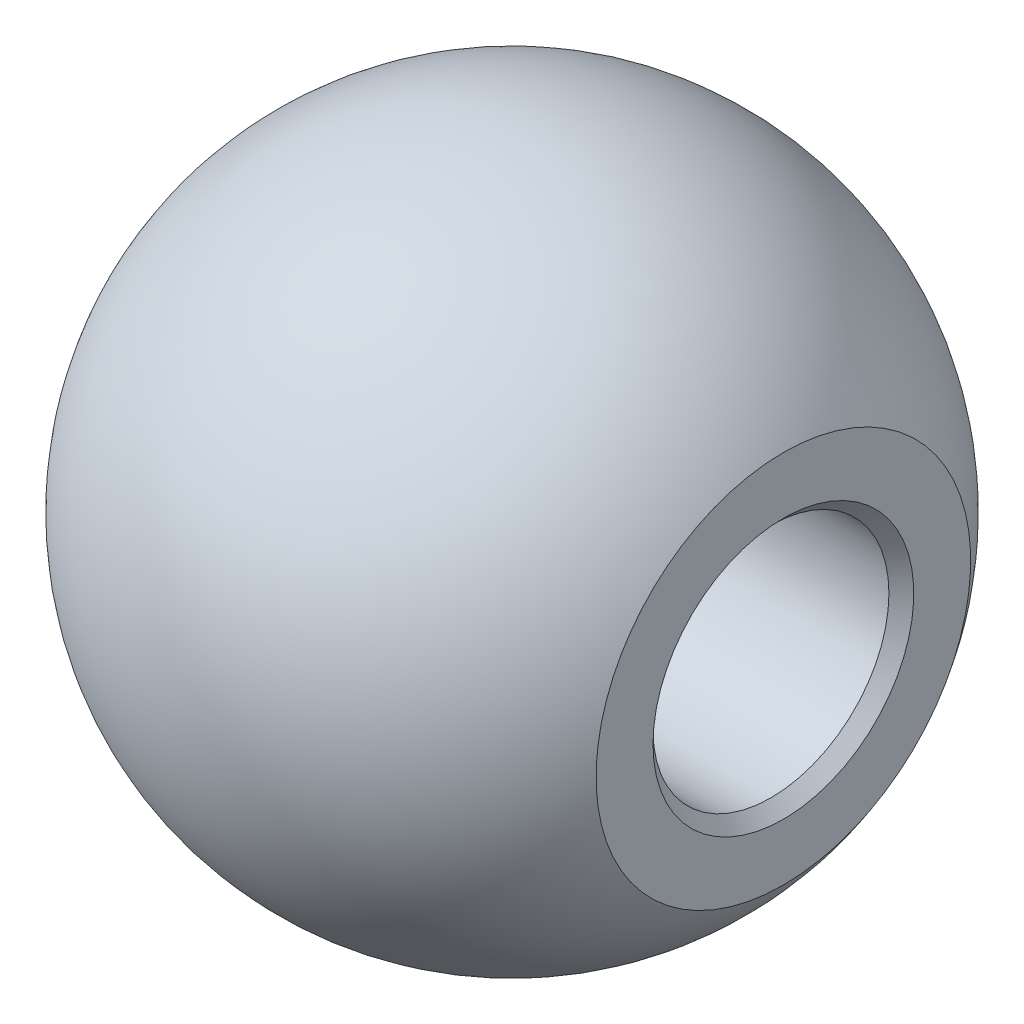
ISO-10303-21;
HEADER;
FILE_DESCRIPTION(('STEP AP214'),'2;1');
FILE_NAME('part.step','',(''),(''),'','','');
FILE_SCHEMA(('AUTOMOTIVE_DESIGN { 1 0 10303 214 1 1 1 1 }'));
ENDSEC;
DATA;
#1=APPLICATION_CONTEXT('core data for automotive mechanical design processes');
#2=APPLICATION_PROTOCOL_DEFINITION('international standard','automotive_design',2000,#1);
#3=PRODUCT_CONTEXT('',#1,'mechanical');
#4=PRODUCT('Part','Part','',(#3));
#5=PRODUCT_RELATED_PRODUCT_CATEGORY('part','',(#4));
#6=PRODUCT_DEFINITION_FORMATION('','',#4);
#7=PRODUCT_DEFINITION_CONTEXT('part definition',#1,'design');
#8=PRODUCT_DEFINITION('design','',#6,#7);
#9=PRODUCT_DEFINITION_SHAPE('','',#8);
#10=(LENGTH_UNIT() NAMED_UNIT(*) SI_UNIT(.MILLI.,.METRE.));
#11=(NAMED_UNIT(*) PLANE_ANGLE_UNIT() SI_UNIT($,.RADIAN.));
#12=(NAMED_UNIT(*) SI_UNIT($,.STERADIAN.) SOLID_ANGLE_UNIT());
#13=UNCERTAINTY_MEASURE_WITH_UNIT(LENGTH_MEASURE(1.E-05),#10,'distance_accuracy_value','');
#14=(GEOMETRIC_REPRESENTATION_CONTEXT(3) GLOBAL_UNCERTAINTY_ASSIGNED_CONTEXT((#13)) GLOBAL_UNIT_ASSIGNED_CONTEXT((#10,
#11,#12)) REPRESENTATION_CONTEXT('',''));
#15=CARTESIAN_POINT('',(0.,0.,0.));
#16=DIRECTION('',(0.,0.,1.));
#17=DIRECTION('',(1.,0.,0.));
#18=AXIS2_PLACEMENT_3D('',#15,#16,#17);
#19=CARTESIAN_POINT('',(0.,0.,0.));
#20=DIRECTION('',(-1.,0.,0.));
#21=DIRECTION('',(0.,0.,1.));
#22=AXIS2_PLACEMENT_3D('',#19,#20,#21);
#23=CYLINDRICAL_SURFACE('',#22,2.413);
#24=CARTESIAN_POINT('',(5.2959,0.,0.));
#25=DIRECTION('',(-1.,0.,0.));
#26=DIRECTION('',(0.,0.,1.));
#27=AXIS2_PLACEMENT_3D('',#24,#25,#26);
#28=CIRCLE('',#27,2.413);
#29=CARTESIAN_POINT('',(5.2959,0.,2.413));
#30=VERTEX_POINT('',#29);
#31=EDGE_CURVE('E10',#30,#30,#28,.F.);
#32=ORIENTED_EDGE('',*,*,#31,.T.);
#33=EDGE_LOOP('',(#32));
#34=FACE_BOUND('',#33,.T.);
#35=CARTESIAN_POINT('',(-5.2959,0.,0.));
#36=DIRECTION('',(-1.,0.,0.));
#37=DIRECTION('',(0.,0.,1.));
#38=AXIS2_PLACEMENT_3D('',#35,#36,#37);
#39=CIRCLE('',#38,2.413);
#40=CARTESIAN_POINT('',(-5.2959,0.,2.413));
#41=VERTEX_POINT('',#40);
#42=EDGE_CURVE('E46',#41,#41,#39,.F.);
#43=ORIENTED_EDGE('',*,*,#42,.F.);
#44=EDGE_LOOP('',(#43));
#45=FACE_BOUND('',#44,.T.);
#46=ADVANCED_FACE('F31',(#34,#45),#23,.F.);
#47=CARTESIAN_POINT('',(5.5499,2.413,0.));
#48=DIRECTION('',(-1.,0.,0.));
#49=DIRECTION('',(0.,0.,1.));
#50=AXIS2_PLACEMENT_3D('',#47,#48,#49);
#51=PLANE('',#50);
#52=CARTESIAN_POINT('',(5.5499,0.,0.));
#53=DIRECTION('',(-1.,0.,0.));
#54=DIRECTION('',(0.,0.,1.));
#55=AXIS2_PLACEMENT_3D('',#52,#53,#54);
#56=CIRCLE('',#55,2.667);
#57=CARTESIAN_POINT('',(5.5499,0.,2.667));
#58=VERTEX_POINT('',#57);
#59=EDGE_CURVE('E38',#58,#58,#56,.T.);
#60=ORIENTED_EDGE('',*,*,#59,.T.);
#61=EDGE_LOOP('',(#60));
#62=FACE_BOUND('',#61,.T.);
#63=CARTESIAN_POINT('',(5.5499,0.,0.));
#64=DIRECTION('',(-1.,0.,0.));
#65=DIRECTION('',(0.,0.,1.));
#66=AXIS2_PLACEMENT_3D('',#63,#64,#65);
#67=CIRCLE('',#66,3.8309397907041);
#68=CARTESIAN_POINT('',(5.5499,3.8309397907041,0.));
#69=VERTEX_POINT('',#68);
#70=EDGE_CURVE('E42',#69,#69,#67,.T.);
#71=ORIENTED_EDGE('',*,*,#70,.F.);
#72=EDGE_LOOP('',(#71));
#73=FACE_BOUND('',#72,.T.);
#74=ADVANCED_FACE('F62',(#62,#73),#51,.F.);
#75=CARTESIAN_POINT('',(0.,0.,0.));
#76=DIRECTION('',(-1.,0.,0.));
#77=DIRECTION('',(0.,1.,0.));
#78=AXIS2_PLACEMENT_3D('',#75,#76,#77);
#79=SPHERICAL_SURFACE('',#78,6.7437);
#80=CARTESIAN_POINT('',(-5.5499,0.,0.));
#81=DIRECTION('',(-1.,0.,0.));
#82=DIRECTION('',(0.,0.,1.));
#83=AXIS2_PLACEMENT_3D('',#80,#81,#82);
#84=CIRCLE('',#83,3.8309397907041);
#85=CARTESIAN_POINT('',(-5.5499,3.8309397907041,0.));
#86=VERTEX_POINT('',#85);
#87=EDGE_CURVE('E54',#86,#86,#84,.T.);
#88=CARTESIAN_POINT('',(5.5499,3.8309397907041,0.));
#89=CARTESIAN_POINT('',(5.47275635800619,3.94270758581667,0.));
#90=CARTESIAN_POINT('',(5.39222826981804,4.05213850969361,0.));
#91=CARTESIAN_POINT('',(5.22471561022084,4.26594188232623,0.));
#92=CARTESIAN_POINT('',(5.13773103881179,4.37031433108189,0.));
#93=CARTESIAN_POINT('',(4.95761782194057,4.57361602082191,0.));
#94=CARTESIAN_POINT('',(4.8644891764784,4.67254526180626,0.));
#95=CARTESIAN_POINT('',(4.67242895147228,4.86460061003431,0.));
#96=CARTESIAN_POINT('',(4.57349737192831,4.95772671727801,0.));
#97=CARTESIAN_POINT('',(4.37019190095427,5.13783572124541,0.));
#98=CARTESIAN_POINT('',(4.26581800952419,5.22481861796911,0.));
#99=CARTESIAN_POINT('',(4.05200884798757,5.39232389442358,0.));
#100=CARTESIAN_POINT('',(3.94257357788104,5.47284627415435,0.));
#101=CARTESIAN_POINT('',(3.71904093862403,5.62713668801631,0.));
#102=CARTESIAN_POINT('',(3.60494356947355,5.7009047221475,0.));
#103=CARTESIAN_POINT('',(3.37250305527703,5.84141728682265,0.));
#104=CARTESIAN_POINT('',(3.25415991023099,5.90816181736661,0.));
#105=CARTESIAN_POINT('',(3.01365965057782,6.03438383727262,0.));
#106=CARTESIAN_POINT('',(2.89150253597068,6.09386132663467,0.));
#107=CARTESIAN_POINT('',(2.64382006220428,6.20533224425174,0.));
#108=CARTESIAN_POINT('',(2.51829470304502,6.25732567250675,0.));
#109=CARTESIAN_POINT('',(2.26433375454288,6.35363875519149,0.));
#110=CARTESIAN_POINT('',(2.13589816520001,6.3979584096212,0.));
#111=CARTESIAN_POINT('',(1.87658538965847,6.47876223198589,0.));
#112=CARTESIAN_POINT('',(1.7457082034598,6.51524639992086,0.));
#113=CARTESIAN_POINT('',(1.48198977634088,6.58024612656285,0.));
#114=CARTESIAN_POINT('',(1.34914853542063,6.60876168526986,0.));
#115=CARTESIAN_POINT('',(1.08198670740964,6.65772014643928,0.));
#116=CARTESIAN_POINT('',(0.947666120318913,6.67816304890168,0.));
#117=CARTESIAN_POINT('',(0.678035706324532,6.71090160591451,0.));
#118=CARTESIAN_POINT('',(0.542725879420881,6.72319726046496,0.));
#119=CARTESIAN_POINT('',(0.271610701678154,6.7395964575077,0.));
#120=CARTESIAN_POINT('',(0.135805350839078,6.7437,0.));
#121=CARTESIAN_POINT('',(-0.135805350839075,6.7437,0.));
#122=CARTESIAN_POINT('',(-0.271610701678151,6.7395964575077,0.));
#123=CARTESIAN_POINT('',(-0.542725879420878,6.72319726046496,0.));
#124=CARTESIAN_POINT('',(-0.67803570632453,6.71090160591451,0.));
#125=CARTESIAN_POINT('',(-0.94766612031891,6.67816304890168,0.));
#126=CARTESIAN_POINT('',(-1.08198670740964,6.65772014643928,0.));
#127=CARTESIAN_POINT('',(-1.34914853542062,6.60876168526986,0.));
#128=CARTESIAN_POINT('',(-1.48198977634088,6.58024612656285,0.));
#129=CARTESIAN_POINT('',(-1.7457082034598,6.51524639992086,0.));
#130=CARTESIAN_POINT('',(-1.87658538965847,6.47876223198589,0.));
#131=CARTESIAN_POINT('',(-2.13589816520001,6.3979584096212,0.));
#132=CARTESIAN_POINT('',(-2.26433375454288,6.35363875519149,0.));
#133=CARTESIAN_POINT('',(-2.51829470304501,6.25732567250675,0.));
#134=CARTESIAN_POINT('',(-2.64382006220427,6.20533224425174,0.));
#135=CARTESIAN_POINT('',(-2.89150253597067,6.09386132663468,0.));
#136=CARTESIAN_POINT('',(-3.01365965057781,6.03438383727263,0.));
#137=CARTESIAN_POINT('',(-3.25415991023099,5.90816181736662,0.));
#138=CARTESIAN_POINT('',(-3.37250305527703,5.84141728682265,0.));
#139=CARTESIAN_POINT('',(-3.60494356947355,5.7009047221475,0.));
#140=CARTESIAN_POINT('',(-3.71904093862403,5.62713668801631,0.));
#141=CARTESIAN_POINT('',(-3.94257357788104,5.47284627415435,0.));
#142=CARTESIAN_POINT('',(-4.05200884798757,5.39232389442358,0.));
#143=CARTESIAN_POINT('',(-4.26581800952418,5.22481861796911,0.));
#144=CARTESIAN_POINT('',(-4.37019190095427,5.13783572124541,0.));
#145=CARTESIAN_POINT('',(-4.57349737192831,4.95772671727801,0.));
#146=CARTESIAN_POINT('',(-4.67242895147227,4.86460061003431,0.));
#147=CARTESIAN_POINT('',(-4.8644891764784,4.67254526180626,0.));
#148=CARTESIAN_POINT('',(-4.95761782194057,4.57361602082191,0.));
#149=CARTESIAN_POINT('',(-5.13773103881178,4.37031433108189,0.));
#150=CARTESIAN_POINT('',(-5.22471561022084,4.26594188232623,0.));
#151=CARTESIAN_POINT('',(-5.39222826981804,4.05213850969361,0.));
#152=CARTESIAN_POINT('',(-5.47275635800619,3.94270758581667,0.));
#153=CARTESIAN_POINT('',(-5.5499,3.8309397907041,0.));
#154=B_SPLINE_CURVE_WITH_KNOTS('',3,(#88,#89,#90,#91,#92,#93,#94,#95,#96,#97,#98,#99,#100,#101,
#102,#103,#104,#105,#106,#107,#108,#109,#110,#111,#112,#113,#114,#115,#116,#117,#118,#119,#120,
#121,#122,#123,#124,#125,#126,#127,#128,#129,#130,#131,#132,#133,#134,#135,#136,#137,#138,#139,
#140,#141,#142,#143,#144,#145,#146,#147,#148,#149,#150,#151,#152,#153),.UNSPECIFIED.,.F.,.F.,(4,
2,2,2,2,2,2,2,2,2,2,2,2,2,2,2,2,2,2,2,2,2,2,2,2,2,2,2,2,2,2,2,4),(0.,0.407354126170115,
0.814708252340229,1.22206237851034,1.62941650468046,2.03677063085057,2.44412475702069,
2.8514788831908,3.25883300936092,3.66618713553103,4.07354126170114,4.48089538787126,
4.88824951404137,5.29560364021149,5.7029577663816,6.11031189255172,6.51766601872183,
6.92502014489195,7.33237427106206,7.73972839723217,8.14708252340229,8.55443664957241,
8.96179077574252,9.36914490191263,9.77649902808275,10.1838531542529,10.591207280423,
10.9985614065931,11.4059155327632,11.8132696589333,12.2206237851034,12.6279779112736,
13.0353320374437),.UNSPECIFIED.);
#155=EDGE_CURVE('BSEAM60',#69,#86,#154,.T.);
#156=ORIENTED_EDGE('',*,*,#70,.T.);
#157=ORIENTED_EDGE('',*,*,#87,.F.);
#158=ORIENTED_EDGE('',*,*,#155,.T.);
#159=ORIENTED_EDGE('',*,*,#155,.F.);
#160=EDGE_LOOP('',(#156,#158,#157,#159));
#161=FACE_BOUND('',#160,.T.);
#162=ADVANCED_FACE('F60',(#161),#79,.T.);
#163=CARTESIAN_POINT('',(5.5499,0.,0.));
#164=DIRECTION('',(1.,0.,0.));
#165=DIRECTION('',(0.,0.,-1.));
#166=AXIS2_PLACEMENT_3D('',#163,#164,#165);
#167=CONICAL_SURFACE('',#166,2.667,0.785398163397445);
#168=ORIENTED_EDGE('',*,*,#31,.F.);
#169=EDGE_LOOP('',(#168));
#170=FACE_BOUND('',#169,.T.);
#171=ORIENTED_EDGE('',*,*,#59,.F.);
#172=EDGE_LOOP('',(#171));
#173=FACE_BOUND('',#172,.T.);
#174=ADVANCED_FACE('F33',(#170,#173),#167,.F.);
#175=CARTESIAN_POINT('',(-5.5499,2.413,0.));
#176=DIRECTION('',(1.,0.,0.));
#177=DIRECTION('',(0.,0.,1.));
#178=AXIS2_PLACEMENT_3D('',#175,#176,#177);
#179=PLANE('',#178);
#180=CARTESIAN_POINT('',(-5.5499,0.,0.));
#181=DIRECTION('',(-1.,0.,0.));
#182=DIRECTION('',(0.,0.,1.));
#183=AXIS2_PLACEMENT_3D('',#180,#181,#182);
#184=CIRCLE('',#183,2.667);
#185=CARTESIAN_POINT('',(-5.5499,0.,2.667));
#186=VERTEX_POINT('',#185);
#187=EDGE_CURVE('E51',#186,#186,#184,.T.);
#188=ORIENTED_EDGE('',*,*,#187,.F.);
#189=EDGE_LOOP('',(#188));
#190=FACE_BOUND('',#189,.T.);
#191=ORIENTED_EDGE('',*,*,#87,.T.);
#192=EDGE_LOOP('',(#191));
#193=FACE_BOUND('',#192,.T.);
#194=ADVANCED_FACE('F58',(#190,#193),#179,.F.);
#195=CARTESIAN_POINT('',(-5.5499,0.,0.));
#196=DIRECTION('',(-1.,0.,0.));
#197=DIRECTION('',(0.,0.,-1.));
#198=AXIS2_PLACEMENT_3D('',#195,#196,#197);
#199=CONICAL_SURFACE('',#198,2.667,0.785398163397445);
#200=ORIENTED_EDGE('',*,*,#42,.T.);
#201=EDGE_LOOP('',(#200));
#202=FACE_BOUND('',#201,.T.);
#203=ORIENTED_EDGE('',*,*,#187,.T.);
#204=EDGE_LOOP('',(#203));
#205=FACE_BOUND('',#204,.T.);
#206=ADVANCED_FACE('F78',(#202,#205),#199,.F.);
#207=CLOSED_SHELL('',(#46,#74,#162,#174,#194,#206));
#208=MANIFOLD_SOLID_BREP('B2',#207);
#209=ADVANCED_BREP_SHAPE_REPRESENTATION('',(#18,#208),#14);
#210=SHAPE_DEFINITION_REPRESENTATION(#9,#209);
ENDSEC;
END-ISO-10303-21;
